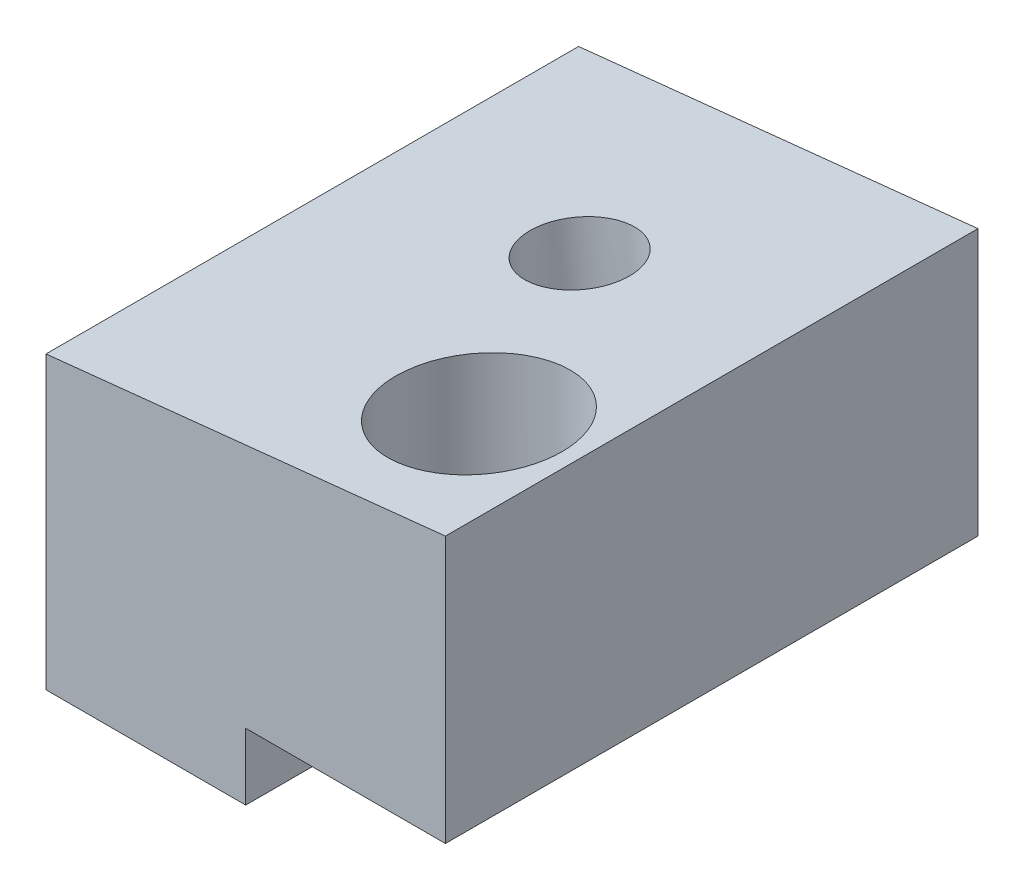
ISO-10303-21;
HEADER;
FILE_DESCRIPTION(('STEP AP214'),'2;1');
FILE_NAME('part.step','',(''),(''),'','','');
FILE_SCHEMA(('AUTOMOTIVE_DESIGN { 1 0 10303 214 1 1 1 1 }'));
ENDSEC;
DATA;
#1=APPLICATION_CONTEXT('core data for automotive mechanical design processes');
#2=APPLICATION_PROTOCOL_DEFINITION('international standard','automotive_design',2000,#1);
#3=PRODUCT_CONTEXT('',#1,'mechanical');
#4=PRODUCT('Part','Part','',(#3));
#5=PRODUCT_RELATED_PRODUCT_CATEGORY('part','',(#4));
#6=PRODUCT_DEFINITION_FORMATION('','',#4);
#7=PRODUCT_DEFINITION_CONTEXT('part definition',#1,'design');
#8=PRODUCT_DEFINITION('design','',#6,#7);
#9=PRODUCT_DEFINITION_SHAPE('','',#8);
#10=(LENGTH_UNIT() NAMED_UNIT(*) SI_UNIT(.MILLI.,.METRE.));
#11=(NAMED_UNIT(*) PLANE_ANGLE_UNIT() SI_UNIT($,.RADIAN.));
#12=(NAMED_UNIT(*) SI_UNIT($,.STERADIAN.) SOLID_ANGLE_UNIT());
#13=UNCERTAINTY_MEASURE_WITH_UNIT(LENGTH_MEASURE(1.E-05),#10,'distance_accuracy_value','');
#14=(GEOMETRIC_REPRESENTATION_CONTEXT(3) GLOBAL_UNCERTAINTY_ASSIGNED_CONTEXT((#13)) GLOBAL_UNIT_ASSIGNED_CONTEXT((#10,
#11,#12)) REPRESENTATION_CONTEXT('',''));
#15=CARTESIAN_POINT('',(0.,0.,0.));
#16=DIRECTION('',(0.,0.,1.));
#17=DIRECTION('',(1.,0.,0.));
#18=AXIS2_PLACEMENT_3D('',#15,#16,#17);
#19=CARTESIAN_POINT('',(9.525,12.7,25.4));
#20=DIRECTION('',(0.104528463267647,-0.994521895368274,0.));
#21=DIRECTION('',(0.994521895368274,0.104528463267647,0.));
#22=AXIS2_PLACEMENT_3D('',#19,#20,#21);
#23=PLANE('',#22);
#24=CARTESIAN_POINT('',(0.0521789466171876,11.7043663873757,9.525));
#25=DIRECTION('',(-0.104528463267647,0.994521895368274,0.));
#26=DIRECTION('',(-0.994521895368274,-0.104528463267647,0.));
#27=AXIS2_PLACEMENT_3D('',#24,#25,#26);
#28=CIRCLE('',#27,2.3876);
#29=CARTESIAN_POINT('',(-2.3223415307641,11.4547942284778,9.525));
#30=VERTEX_POINT('',#29);
#31=EDGE_CURVE('E168',#30,#30,#28,.T.);
#32=ORIENTED_EDGE('',*,*,#31,.F.);
#33=EDGE_LOOP('',(#32));
#34=FACE_BOUND('',#33,.T.);
#35=DIRECTION('',(-0.994521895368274,-0.104528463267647,0.));
#36=VECTOR('',#35,1.);
#37=CARTESIAN_POINT('',(9.525,12.7,0.));
#38=LINE('',#37,#36);
#39=CARTESIAN_POINT('',(9.525,12.7,0.));
#40=VERTEX_POINT('',#39);
#41=CARTESIAN_POINT('',(-9.525,10.697764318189,0.));
#42=VERTEX_POINT('',#41);
#43=EDGE_CURVE('E120',#40,#42,#38,.T.);
#44=ORIENTED_EDGE('',*,*,#43,.T.);
#45=DIRECTION('',(0.,0.,-1.));
#46=VECTOR('',#45,1.);
#47=CARTESIAN_POINT('',(-9.525,10.697764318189,25.4));
#48=LINE('',#47,#46);
#49=CARTESIAN_POINT('',(-9.525,10.697764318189,25.4));
#50=VERTEX_POINT('',#49);
#51=EDGE_CURVE('E117',#50,#42,#48,.T.);
#52=ORIENTED_EDGE('',*,*,#51,.F.);
#53=DIRECTION('',(-0.994521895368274,-0.104528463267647,0.));
#54=VECTOR('',#53,1.);
#55=CARTESIAN_POINT('',(9.525,12.7,25.4));
#56=LINE('',#55,#54);
#57=CARTESIAN_POINT('',(9.525,12.7,25.4));
#58=VERTEX_POINT('',#57);
#59=EDGE_CURVE('E104',#58,#50,#56,.T.);
#60=ORIENTED_EDGE('',*,*,#59,.F.);
#61=DIRECTION('',(0.,0.,-1.));
#62=VECTOR('',#61,1.);
#63=CARTESIAN_POINT('',(9.525,12.7,25.4));
#64=LINE('',#63,#62);
#65=EDGE_CURVE('E123',#58,#40,#64,.T.);
#66=ORIENTED_EDGE('',*,*,#65,.T.);
#67=EDGE_LOOP('',(#44,#52,#60,#66));
#68=FACE_BOUND('',#67,.T.);
#69=CARTESIAN_POINT('',(4.7752,12.2007759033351,19.05));
#70=DIRECTION('',(0.104528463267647,-0.994521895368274,0.));
#71=DIRECTION('',(-0.994521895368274,-0.104528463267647,0.));
#72=AXIS2_PLACEMENT_3D('',#69,#70,#71);
#73=ELLIPSE('',#72,3.98422600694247,3.9624);
#74=CARTESIAN_POINT('',(0.8128,11.7843108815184,19.05));
#75=VERTEX_POINT('',#74);
#76=EDGE_CURVE('E37',#75,#75,#73,.F.);
#77=ORIENTED_EDGE('',*,*,#76,.F.);
#78=EDGE_LOOP('',(#77));
#79=FACE_BOUND('',#78,.T.);
#80=ADVANCED_FACE('F33',(#34,#68,#79),#23,.F.);
#81=CARTESIAN_POINT('',(4.7752,20.32,19.05));
#82=DIRECTION('',(0.,-1.,0.));
#83=DIRECTION('',(0.,0.,-1.));
#84=AXIS2_PLACEMENT_3D('',#81,#82,#83);
#85=CYLINDRICAL_SURFACE('',#84,2.3876);
#86=CARTESIAN_POINT('',(4.7752,0.,19.05));
#87=DIRECTION('',(0.,1.,0.));
#88=DIRECTION('',(0.,0.,1.));
#89=AXIS2_PLACEMENT_3D('',#86,#87,#88);
#90=CIRCLE('',#89,2.3876);
#91=CARTESIAN_POINT('',(4.7752,0.,21.4376));
#92=VERTEX_POINT('',#91);
#93=EDGE_CURVE('E160',#92,#92,#90,.T.);
#94=ORIENTED_EDGE('',*,*,#93,.F.);
#95=EDGE_LOOP('',(#94));
#96=FACE_BOUND('',#95,.T.);
#97=CARTESIAN_POINT('',(4.7752,6.35,19.05));
#98=DIRECTION('',(0.,1.,0.));
#99=DIRECTION('',(0.,0.,1.));
#100=AXIS2_PLACEMENT_3D('',#97,#98,#99);
#101=CIRCLE('',#100,2.3876);
#102=CARTESIAN_POINT('',(4.7752,6.35,21.4376));
#103=VERTEX_POINT('',#102);
#104=EDGE_CURVE('E154',#103,#103,#101,.T.);
#105=ORIENTED_EDGE('',*,*,#104,.T.);
#106=EDGE_LOOP('',(#105));
#107=FACE_BOUND('',#106,.T.);
#108=ADVANCED_FACE('F203',(#96,#107),#85,.F.);
#109=CARTESIAN_POINT('',(0.,0.,25.4));
#110=DIRECTION('',(0.,1.,0.));
#111=DIRECTION('',(0.,0.,1.));
#112=AXIS2_PLACEMENT_3D('',#109,#110,#111);
#113=PLANE('',#112);
#114=DIRECTION('',(0.,0.,-1.));
#115=VECTOR('',#114,1.);
#116=CARTESIAN_POINT('',(0.,0.,25.4));
#117=LINE('',#116,#115);
#118=CARTESIAN_POINT('',(0.,0.,25.4));
#119=VERTEX_POINT('',#118);
#120=CARTESIAN_POINT('',(0.,0.,11.543455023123));
#121=VERTEX_POINT('',#120);
#122=EDGE_CURVE('E42',#119,#121,#117,.T.);
#123=ORIENTED_EDGE('',*,*,#122,.T.);
#124=CARTESIAN_POINT('',(1.28235742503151,0.,9.525));
#125=DIRECTION('',(0.,1.,0.));
#126=DIRECTION('',(-1.,0.,0.));
#127=AXIS2_PLACEMENT_3D('',#124,#125,#126);
#128=ELLIPSE('',#127,2.40075156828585,2.3876);
#129=CARTESIAN_POINT('',(0.,0.,7.50654497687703));
#130=VERTEX_POINT('',#129);
#131=EDGE_CURVE('E135',#121,#130,#128,.T.);
#132=ORIENTED_EDGE('',*,*,#131,.T.);
#133=CARTESIAN_POINT('',(0.,0.,0.));
#134=VERTEX_POINT('',#133);
#135=EDGE_CURVE('E153',#130,#134,#117,.T.);
#136=ORIENTED_EDGE('',*,*,#135,.T.);
#137=DIRECTION('',(1.,0.,0.));
#138=VECTOR('',#137,1.);
#139=CARTESIAN_POINT('',(0.,0.,0.));
#140=LINE('',#139,#138);
#141=CARTESIAN_POINT('',(9.525,0.,0.));
#142=VERTEX_POINT('',#141);
#143=EDGE_CURVE('E134',#134,#142,#140,.T.);
#144=ORIENTED_EDGE('',*,*,#143,.T.);
#145=DIRECTION('',(0.,0.,-1.));
#146=VECTOR('',#145,1.);
#147=CARTESIAN_POINT('',(9.525,0.,25.4));
#148=LINE('',#147,#146);
#149=CARTESIAN_POINT('',(9.525,0.,25.4));
#150=VERTEX_POINT('',#149);
#151=EDGE_CURVE('E150',#150,#142,#148,.T.);
#152=ORIENTED_EDGE('',*,*,#151,.F.);
#153=DIRECTION('',(1.,0.,0.));
#154=VECTOR('',#153,1.);
#155=CARTESIAN_POINT('',(0.,0.,25.4));
#156=LINE('',#155,#154);
#157=EDGE_CURVE('E95',#119,#150,#156,.T.);
#158=ORIENTED_EDGE('',*,*,#157,.F.);
#159=EDGE_LOOP('',(#123,#132,#136,#144,#152,#158));
#160=FACE_BOUND('',#159,.T.);
#161=ORIENTED_EDGE('',*,*,#93,.T.);
#162=EDGE_LOOP('',(#161));
#163=FACE_BOUND('',#162,.T.);
#164=ADVANCED_FACE('F178',(#160,#163),#113,.F.);
#165=CARTESIAN_POINT('',(0.,-3.175,25.4));
#166=DIRECTION('',(-1.,0.,0.));
#167=DIRECTION('',(0.,0.,1.));
#168=AXIS2_PLACEMENT_3D('',#165,#166,#167);
#169=PLANE('',#168);
#170=ORIENTED_EDGE('',*,*,#135,.F.);
#171=CARTESIAN_POINT('',(0.,12.2008159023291,9.525));
#172=DIRECTION('',(-1.,0.,0.));
#173=DIRECTION('',(0.,1.,0.));
#174=AXIS2_PLACEMENT_3D('',#171,#172,#173);
#175=ELLIPSE('',#174,22.8416253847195,2.3876);
#176=CARTESIAN_POINT('',(0.,-3.175,7.75935324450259));
#177=VERTEX_POINT('',#176);
#178=EDGE_CURVE('E172',#130,#177,#175,.T.);
#179=ORIENTED_EDGE('',*,*,#178,.T.);
#180=DIRECTION('',(0.,0.,-1.));
#181=VECTOR('',#180,1.);
#182=CARTESIAN_POINT('',(0.,-3.175,25.4));
#183=LINE('',#182,#181);
#184=CARTESIAN_POINT('',(0.,-3.175,0.));
#185=VERTEX_POINT('',#184);
#186=EDGE_CURVE('E86',#177,#185,#183,.T.);
#187=ORIENTED_EDGE('',*,*,#186,.T.);
#188=DIRECTION('',(0.,1.,0.));
#189=VECTOR('',#188,1.);
#190=CARTESIAN_POINT('',(0.,-3.175,0.));
#191=LINE('',#190,#189);
#192=EDGE_CURVE('E132',#185,#134,#191,.T.);
#193=ORIENTED_EDGE('',*,*,#192,.T.);
#194=EDGE_LOOP('',(#170,#179,#187,#193));
#195=FACE_BOUND('',#194,.T.);
#196=ADVANCED_FACE('F197',(#195),#169,.F.);
#197=CARTESIAN_POINT('',(0.,-3.175,25.4));
#198=VERTEX_POINT('',#197);
#199=CARTESIAN_POINT('',(0.,-3.175,11.2906467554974));
#200=VERTEX_POINT('',#199);
#201=EDGE_CURVE('E145',#198,#200,#183,.T.);
#202=ORIENTED_EDGE('',*,*,#201,.T.);
#203=EDGE_CURVE('E50',#200,#121,#175,.T.);
#204=ORIENTED_EDGE('',*,*,#203,.T.);
#205=ORIENTED_EDGE('',*,*,#122,.F.);
#206=DIRECTION('',(0.,1.,0.));
#207=VECTOR('',#206,1.);
#208=CARTESIAN_POINT('',(0.,-3.175,25.4));
#209=LINE('',#208,#207);
#210=EDGE_CURVE('E144',#198,#119,#209,.T.);
#211=ORIENTED_EDGE('',*,*,#210,.F.);
#212=EDGE_LOOP('',(#202,#204,#205,#211));
#213=FACE_BOUND('',#212,.T.);
#214=ADVANCED_FACE('F35',(#213),#169,.F.);
#215=CARTESIAN_POINT('',(9.525,0.,25.4));
#216=DIRECTION('',(-1.,0.,0.));
#217=DIRECTION('',(0.,0.,1.));
#218=AXIS2_PLACEMENT_3D('',#215,#216,#217);
#219=PLANE('',#218);
#220=DIRECTION('',(0.,1.,0.));
#221=VECTOR('',#220,1.);
#222=CARTESIAN_POINT('',(9.525,0.,0.));
#223=LINE('',#222,#221);
#224=EDGE_CURVE('E137',#142,#40,#223,.T.);
#225=ORIENTED_EDGE('',*,*,#224,.T.);
#226=ORIENTED_EDGE('',*,*,#65,.F.);
#227=DIRECTION('',(0.,1.,0.));
#228=VECTOR('',#227,1.);
#229=CARTESIAN_POINT('',(9.525,0.,25.4));
#230=LINE('',#229,#228);
#231=EDGE_CURVE('E111',#150,#58,#230,.T.);
#232=ORIENTED_EDGE('',*,*,#231,.F.);
#233=ORIENTED_EDGE('',*,*,#151,.T.);
#234=EDGE_LOOP('',(#225,#226,#232,#233));
#235=FACE_BOUND('',#234,.T.);
#236=ADVANCED_FACE('F183',(#235),#219,.F.);
#237=CARTESIAN_POINT('',(-9.525,10.697764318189,25.4));
#238=DIRECTION('',(1.,0.,0.));
#239=DIRECTION('',(0.,1.,0.));
#240=AXIS2_PLACEMENT_3D('',#237,#238,#239);
#241=PLANE('',#240);
#242=DIRECTION('',(0.,-1.,0.));
#243=VECTOR('',#242,1.);
#244=CARTESIAN_POINT('',(-9.525,10.697764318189,0.));
#245=LINE('',#244,#243);
#246=CARTESIAN_POINT('',(-9.525,-3.175,0.));
#247=VERTEX_POINT('',#246);
#248=EDGE_CURVE('E140',#42,#247,#245,.T.);
#249=ORIENTED_EDGE('',*,*,#248,.T.);
#250=DIRECTION('',(0.,0.,-1.));
#251=VECTOR('',#250,1.);
#252=CARTESIAN_POINT('',(-9.525,-3.175,25.4));
#253=LINE('',#252,#251);
#254=CARTESIAN_POINT('',(-9.525,-3.175,25.4));
#255=VERTEX_POINT('',#254);
#256=EDGE_CURVE('E124',#255,#247,#253,.T.);
#257=ORIENTED_EDGE('',*,*,#256,.F.);
#258=DIRECTION('',(0.,-1.,0.));
#259=VECTOR('',#258,1.);
#260=CARTESIAN_POINT('',(-9.525,10.697764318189,25.4));
#261=LINE('',#260,#259);
#262=EDGE_CURVE('E108',#50,#255,#261,.T.);
#263=ORIENTED_EDGE('',*,*,#262,.F.);
#264=ORIENTED_EDGE('',*,*,#51,.T.);
#265=EDGE_LOOP('',(#249,#257,#263,#264));
#266=FACE_BOUND('',#265,.T.);
#267=ADVANCED_FACE('F126',(#266),#241,.F.);
#268=CARTESIAN_POINT('',(-9.525,-3.175,25.4));
#269=DIRECTION('',(0.,1.,0.));
#270=DIRECTION('',(0.,0.,1.));
#271=AXIS2_PLACEMENT_3D('',#268,#269,#270);
#272=PLANE('',#271);
#273=ORIENTED_EDGE('',*,*,#186,.F.);
#274=CARTESIAN_POINT('',(1.61606337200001,-3.175,9.525));
#275=DIRECTION('',(0.,1.,0.));
#276=DIRECTION('',(-1.,0.,0.));
#277=AXIS2_PLACEMENT_3D('',#274,#275,#276);
#278=ELLIPSE('',#277,2.40075156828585,2.3876);
#279=EDGE_CURVE('E11',#177,#200,#278,.T.);
#280=ORIENTED_EDGE('',*,*,#279,.T.);
#281=ORIENTED_EDGE('',*,*,#201,.F.);
#282=DIRECTION('',(1.,0.,0.));
#283=VECTOR('',#282,1.);
#284=CARTESIAN_POINT('',(-9.525,-3.175,25.4));
#285=LINE('',#284,#283);
#286=EDGE_CURVE('E58',#255,#198,#285,.T.);
#287=ORIENTED_EDGE('',*,*,#286,.F.);
#288=ORIENTED_EDGE('',*,*,#256,.T.);
#289=DIRECTION('',(1.,0.,0.));
#290=VECTOR('',#289,1.);
#291=CARTESIAN_POINT('',(-9.525,-3.175,0.));
#292=LINE('',#291,#290);
#293=EDGE_CURVE('E142',#247,#185,#292,.T.);
#294=ORIENTED_EDGE('',*,*,#293,.T.);
#295=EDGE_LOOP('',(#273,#280,#281,#287,#288,#294));
#296=FACE_BOUND('',#295,.T.);
#297=ADVANCED_FACE('F189',(#296),#272,.F.);
#298=CARTESIAN_POINT('',(0.,0.,25.4));
#299=DIRECTION('',(0.,0.,-1.));
#300=DIRECTION('',(-1.,0.,0.));
#301=AXIS2_PLACEMENT_3D('',#298,#299,#300);
#302=PLANE('',#301);
#303=ORIENTED_EDGE('',*,*,#210,.T.);
#304=ORIENTED_EDGE('',*,*,#157,.T.);
#305=ORIENTED_EDGE('',*,*,#231,.T.);
#306=ORIENTED_EDGE('',*,*,#59,.T.);
#307=ORIENTED_EDGE('',*,*,#262,.T.);
#308=ORIENTED_EDGE('',*,*,#286,.T.);
#309=EDGE_LOOP('',(#303,#304,#305,#306,#307,#308));
#310=FACE_BOUND('',#309,.T.);
#311=ADVANCED_FACE('F106',(#310),#302,.F.);
#312=CARTESIAN_POINT('',(0.,0.,0.));
#313=DIRECTION('',(0.,0.,-1.));
#314=DIRECTION('',(-1.,0.,0.));
#315=AXIS2_PLACEMENT_3D('',#312,#313,#314);
#316=PLANE('',#315);
#317=ORIENTED_EDGE('',*,*,#192,.F.);
#318=ORIENTED_EDGE('',*,*,#293,.F.);
#319=ORIENTED_EDGE('',*,*,#248,.F.);
#320=ORIENTED_EDGE('',*,*,#43,.F.);
#321=ORIENTED_EDGE('',*,*,#224,.F.);
#322=ORIENTED_EDGE('',*,*,#143,.F.);
#323=EDGE_LOOP('',(#317,#318,#319,#320,#321,#322));
#324=FACE_BOUND('',#323,.T.);
#325=ADVANCED_FACE('F186',(#324),#316,.T.);
#326=CARTESIAN_POINT('',(1.64519272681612,-3.45214729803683,9.525));
#327=DIRECTION('',(-0.104528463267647,0.994521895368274,0.));
#328=DIRECTION('',(-0.994521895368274,-0.104528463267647,0.));
#329=AXIS2_PLACEMENT_3D('',#326,#327,#328);
#330=CYLINDRICAL_SURFACE('',#329,2.3876);
#331=ORIENTED_EDGE('',*,*,#31,.T.);
#332=EDGE_LOOP('',(#331));
#333=FACE_BOUND('',#332,.T.);
#334=ORIENTED_EDGE('',*,*,#203,.F.);
#335=ORIENTED_EDGE('',*,*,#279,.F.);
#336=ORIENTED_EDGE('',*,*,#178,.F.);
#337=ORIENTED_EDGE('',*,*,#131,.F.);
#338=EDGE_LOOP('',(#334,#335,#336,#337));
#339=FACE_BOUND('',#338,.T.);
#340=ADVANCED_FACE('F196',(#333,#339),#330,.F.);
#341=CARTESIAN_POINT('',(4.7752,26.67,19.05));
#342=DIRECTION('',(0.,-1.,0.));
#343=DIRECTION('',(0.,0.,-1.));
#344=AXIS2_PLACEMENT_3D('',#341,#342,#343);
#345=CYLINDRICAL_SURFACE('',#344,3.9624);
#346=CARTESIAN_POINT('',(4.7752,6.35,19.05));
#347=DIRECTION('',(0.,1.,0.));
#348=DIRECTION('',(0.,0.,1.));
#349=AXIS2_PLACEMENT_3D('',#346,#347,#348);
#350=CIRCLE('',#349,3.9624);
#351=CARTESIAN_POINT('',(4.7752,6.35,23.0124));
#352=VERTEX_POINT('',#351);
#353=EDGE_CURVE('E156',#352,#352,#350,.T.);
#354=ORIENTED_EDGE('',*,*,#353,.F.);
#355=EDGE_LOOP('',(#354));
#356=FACE_BOUND('',#355,.T.);
#357=ORIENTED_EDGE('',*,*,#76,.T.);
#358=EDGE_LOOP('',(#357));
#359=FACE_BOUND('',#358,.T.);
#360=ADVANCED_FACE('F231',(#356,#359),#345,.F.);
#361=CARTESIAN_POINT('',(4.7752,6.35,19.05));
#362=DIRECTION('',(0.,1.,0.));
#363=DIRECTION('',(0.,0.,1.));
#364=AXIS2_PLACEMENT_3D('',#361,#362,#363);
#365=PLANE('',#364);
#366=ORIENTED_EDGE('',*,*,#104,.F.);
#367=EDGE_LOOP('',(#366));
#368=FACE_BOUND('',#367,.T.);
#369=ORIENTED_EDGE('',*,*,#353,.T.);
#370=EDGE_LOOP('',(#369));
#371=FACE_BOUND('',#370,.T.);
#372=ADVANCED_FACE('F236',(#368,#371),#365,.T.);
#373=CLOSED_SHELL('',(#80,#108,#164,#196,#214,#236,#267,#297,#311,#325,#340,#360,#372));
#374=MANIFOLD_SOLID_BREP('B2',#373);
#375=ADVANCED_BREP_SHAPE_REPRESENTATION('',(#18,#374),#14);
#376=SHAPE_DEFINITION_REPRESENTATION(#9,#375);
ENDSEC;
END-ISO-10303-21;
